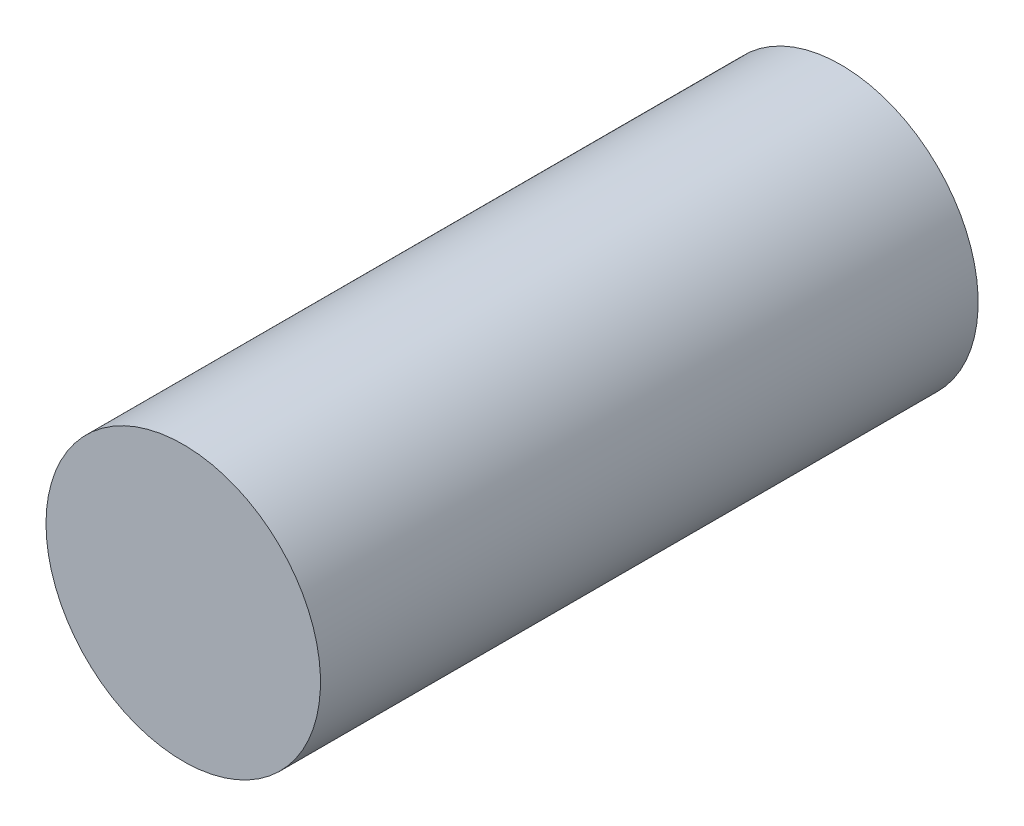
from build123d import *

# Parameters (mm, degrees)
SKETCH1_R      = 31.80207
EXTRUDE1_DEPTH = 76.2


with BuildPart() as part:
    # Sketch1 → Extrude1 (new, symmetric)
    with BuildSketch(Plane.XY):
        with Locations(Location((0, 0, 0), (0, 0, 180))):
            Circle(SKETCH1_R)
    extrude(amount=EXTRUDE1_DEPTH, both=True)


solid = part.part
